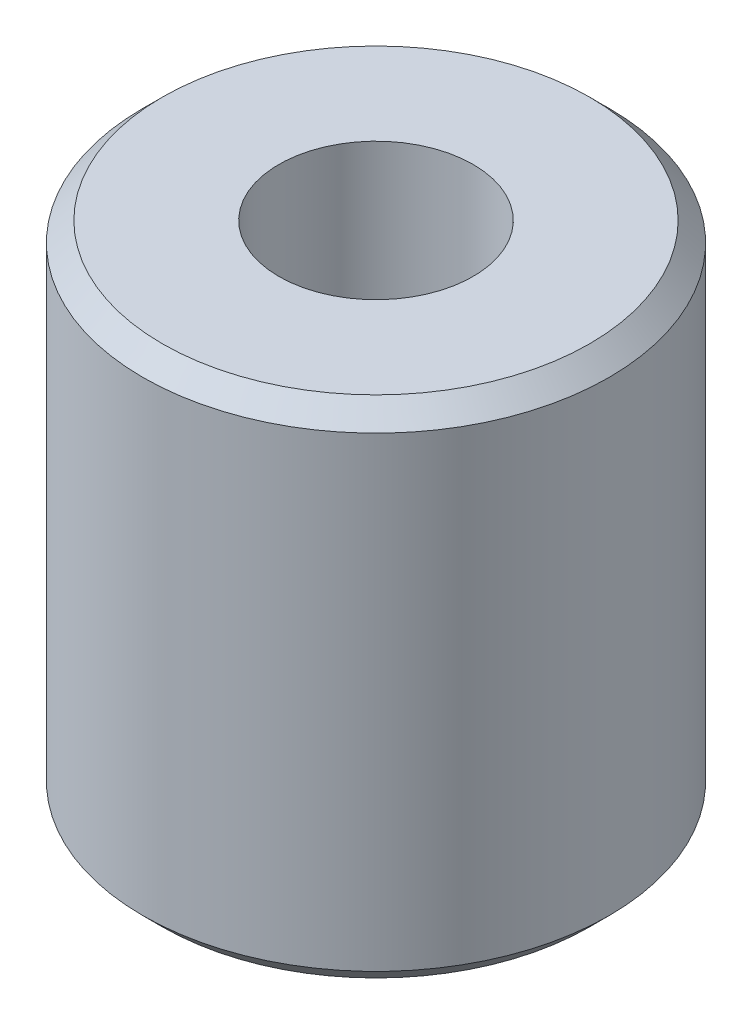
ISO-10303-21;
HEADER;
FILE_DESCRIPTION(('STEP AP214'),'2;1');
FILE_NAME('part.step','',(''),(''),'','','');
FILE_SCHEMA(('AUTOMOTIVE_DESIGN { 1 0 10303 214 1 1 1 1 }'));
ENDSEC;
DATA;
#1=APPLICATION_CONTEXT('core data for automotive mechanical design processes');
#2=APPLICATION_PROTOCOL_DEFINITION('international standard','automotive_design',2000,#1);
#3=PRODUCT_CONTEXT('',#1,'mechanical');
#4=PRODUCT('Part','Part','',(#3));
#5=PRODUCT_RELATED_PRODUCT_CATEGORY('part','',(#4));
#6=PRODUCT_DEFINITION_FORMATION('','',#4);
#7=PRODUCT_DEFINITION_CONTEXT('part definition',#1,'design');
#8=PRODUCT_DEFINITION('design','',#6,#7);
#9=PRODUCT_DEFINITION_SHAPE('','',#8);
#10=(LENGTH_UNIT() NAMED_UNIT(*) SI_UNIT(.MILLI.,.METRE.));
#11=(NAMED_UNIT(*) PLANE_ANGLE_UNIT() SI_UNIT($,.RADIAN.));
#12=(NAMED_UNIT(*) SI_UNIT($,.STERADIAN.) SOLID_ANGLE_UNIT());
#13=UNCERTAINTY_MEASURE_WITH_UNIT(LENGTH_MEASURE(1.E-05),#10,'distance_accuracy_value','');
#14=(GEOMETRIC_REPRESENTATION_CONTEXT(3) GLOBAL_UNCERTAINTY_ASSIGNED_CONTEXT((#13)) GLOBAL_UNIT_ASSIGNED_CONTEXT((#10,
#11,#12)) REPRESENTATION_CONTEXT('',''));
#15=CARTESIAN_POINT('',(0.,0.,0.));
#16=DIRECTION('',(0.,0.,1.));
#17=DIRECTION('',(1.,0.,0.));
#18=AXIS2_PLACEMENT_3D('',#15,#16,#17);
#19=CARTESIAN_POINT('',(0.,-5.99999999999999,0.));
#20=DIRECTION('',(0.,1.,0.));
#21=DIRECTION('',(0.,0.,1.));
#22=AXIS2_PLACEMENT_3D('',#19,#20,#21);
#23=CONICAL_SURFACE('',#22,6.,0.785398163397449);
#24=CARTESIAN_POINT('',(0.,-6.49999999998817,0.));
#25=DIRECTION('',(0.,1.,0.));
#26=DIRECTION('',(0.,0.,1.));
#27=AXIS2_PLACEMENT_3D('',#24,#25,#26);
#28=CIRCLE('',#27,5.50000000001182);
#29=CARTESIAN_POINT('',(0.,-6.49999999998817,5.50000000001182));
#30=VERTEX_POINT('',#29);
#31=EDGE_CURVE('E52',#30,#30,#28,.T.);
#32=ORIENTED_EDGE('',*,*,#31,.T.);
#33=EDGE_LOOP('',(#32));
#34=FACE_BOUND('',#33,.T.);
#35=CARTESIAN_POINT('',(0.,-5.99999999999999,0.));
#36=DIRECTION('',(0.,1.,0.));
#37=DIRECTION('',(0.,0.,1.));
#38=AXIS2_PLACEMENT_3D('',#35,#36,#37);
#39=CIRCLE('',#38,6.);
#40=CARTESIAN_POINT('',(0.,-5.99999999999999,6.));
#41=VERTEX_POINT('',#40);
#42=EDGE_CURVE('E10',#41,#41,#39,.T.);
#43=ORIENTED_EDGE('',*,*,#42,.F.);
#44=EDGE_LOOP('',(#43));
#45=FACE_BOUND('',#44,.T.);
#46=ADVANCED_FACE('F30',(#34,#45),#23,.T.);
#47=CARTESIAN_POINT('',(0.,-6.50000000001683,0.));
#48=DIRECTION('',(0.,1.,0.));
#49=DIRECTION('',(0.,0.,1.));
#50=AXIS2_PLACEMENT_3D('',#47,#48,#49);
#51=CYLINDRICAL_SURFACE('',#50,6.);
#52=ORIENTED_EDGE('',*,*,#42,.T.);
#53=EDGE_LOOP('',(#52));
#54=FACE_BOUND('',#53,.T.);
#55=CARTESIAN_POINT('',(0.,6.00000000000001,0.));
#56=DIRECTION('',(0.,1.,0.));
#57=DIRECTION('',(0.,0.,1.));
#58=AXIS2_PLACEMENT_3D('',#55,#56,#57);
#59=CIRCLE('',#58,6.);
#60=CARTESIAN_POINT('',(0.,6.00000000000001,6.));
#61=VERTEX_POINT('',#60);
#62=EDGE_CURVE('E36',#61,#61,#59,.T.);
#63=ORIENTED_EDGE('',*,*,#62,.F.);
#64=EDGE_LOOP('',(#63));
#65=FACE_BOUND('',#64,.T.);
#66=ADVANCED_FACE('F70',(#54,#65),#51,.T.);
#67=CARTESIAN_POINT('',(0.,6.5000000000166,0.));
#68=DIRECTION('',(0.,-1.,0.));
#69=DIRECTION('',(0.,0.,-1.));
#70=AXIS2_PLACEMENT_3D('',#67,#68,#69);
#71=CONICAL_SURFACE('',#70,5.49999999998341,0.785398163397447);
#72=ORIENTED_EDGE('',*,*,#62,.T.);
#73=EDGE_LOOP('',(#72));
#74=FACE_BOUND('',#73,.T.);
#75=CARTESIAN_POINT('',(0.,6.5000000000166,0.));
#76=DIRECTION('',(0.,1.,0.));
#77=DIRECTION('',(0.,0.,1.));
#78=AXIS2_PLACEMENT_3D('',#75,#76,#77);
#79=CIRCLE('',#78,5.49999999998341);
#80=CARTESIAN_POINT('',(0.,6.5000000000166,5.49999999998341));
#81=VERTEX_POINT('',#80);
#82=EDGE_CURVE('E40',#81,#81,#79,.T.);
#83=ORIENTED_EDGE('',*,*,#82,.F.);
#84=EDGE_LOOP('',(#83));
#85=FACE_BOUND('',#84,.T.);
#86=ADVANCED_FACE('F74',(#74,#85),#71,.T.);
#87=CARTESIAN_POINT('',(2.49999999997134,6.50000000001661,0.));
#88=DIRECTION('',(0.,1.,0.));
#89=DIRECTION('',(0.,0.,1.));
#90=AXIS2_PLACEMENT_3D('',#87,#88,#89);
#91=PLANE('',#90);
#92=ORIENTED_EDGE('',*,*,#82,.T.);
#93=EDGE_LOOP('',(#92));
#94=FACE_BOUND('',#93,.T.);
#95=CARTESIAN_POINT('',(0.,6.50000000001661,0.));
#96=DIRECTION('',(0.,1.,0.));
#97=DIRECTION('',(0.,0.,1.));
#98=AXIS2_PLACEMENT_3D('',#95,#96,#97);
#99=CIRCLE('',#98,2.49999999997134);
#100=CARTESIAN_POINT('',(0.,6.50000000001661,2.49999999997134));
#101=VERTEX_POINT('',#100);
#102=EDGE_CURVE('E44',#101,#101,#99,.T.);
#103=ORIENTED_EDGE('',*,*,#102,.F.);
#104=EDGE_LOOP('',(#103));
#105=FACE_BOUND('',#104,.T.);
#106=ADVANCED_FACE('F66',(#94,#105),#91,.T.);
#107=CARTESIAN_POINT('',(0.,-6.50000000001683,0.));
#108=DIRECTION('',(0.,1.,0.));
#109=DIRECTION('',(0.,0.,1.));
#110=AXIS2_PLACEMENT_3D('',#107,#108,#109);
#111=CYLINDRICAL_SURFACE('',#110,2.49999999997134);
#112=ORIENTED_EDGE('',*,*,#102,.T.);
#113=EDGE_LOOP('',(#112));
#114=FACE_BOUND('',#113,.T.);
#115=CARTESIAN_POINT('',(0.,-6.49999999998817,0.));
#116=DIRECTION('',(0.,1.,0.));
#117=DIRECTION('',(0.,0.,1.));
#118=AXIS2_PLACEMENT_3D('',#115,#116,#117);
#119=CIRCLE('',#118,2.49999999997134);
#120=CARTESIAN_POINT('',(0.,-6.49999999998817,2.49999999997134));
#121=VERTEX_POINT('',#120);
#122=EDGE_CURVE('E49',#121,#121,#119,.T.);
#123=ORIENTED_EDGE('',*,*,#122,.F.);
#124=EDGE_LOOP('',(#123));
#125=FACE_BOUND('',#124,.T.);
#126=ADVANCED_FACE('F60',(#114,#125),#111,.F.);
#127=CARTESIAN_POINT('',(5.50000000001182,-6.49999999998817,0.));
#128=DIRECTION('',(0.,-1.,0.));
#129=DIRECTION('',(0.,0.,-1.));
#130=AXIS2_PLACEMENT_3D('',#127,#128,#129);
#131=PLANE('',#130);
#132=ORIENTED_EDGE('',*,*,#122,.T.);
#133=EDGE_LOOP('',(#132));
#134=FACE_BOUND('',#133,.T.);
#135=ORIENTED_EDGE('',*,*,#31,.F.);
#136=EDGE_LOOP('',(#135));
#137=FACE_BOUND('',#136,.T.);
#138=ADVANCED_FACE('F58',(#134,#137),#131,.T.);
#139=CLOSED_SHELL('',(#46,#66,#86,#106,#126,#138));
#140=MANIFOLD_SOLID_BREP('B2',#139);
#141=ADVANCED_BREP_SHAPE_REPRESENTATION('',(#18,#140),#14);
#142=SHAPE_DEFINITION_REPRESENTATION(#9,#141);
ENDSEC;
END-ISO-10303-21;
